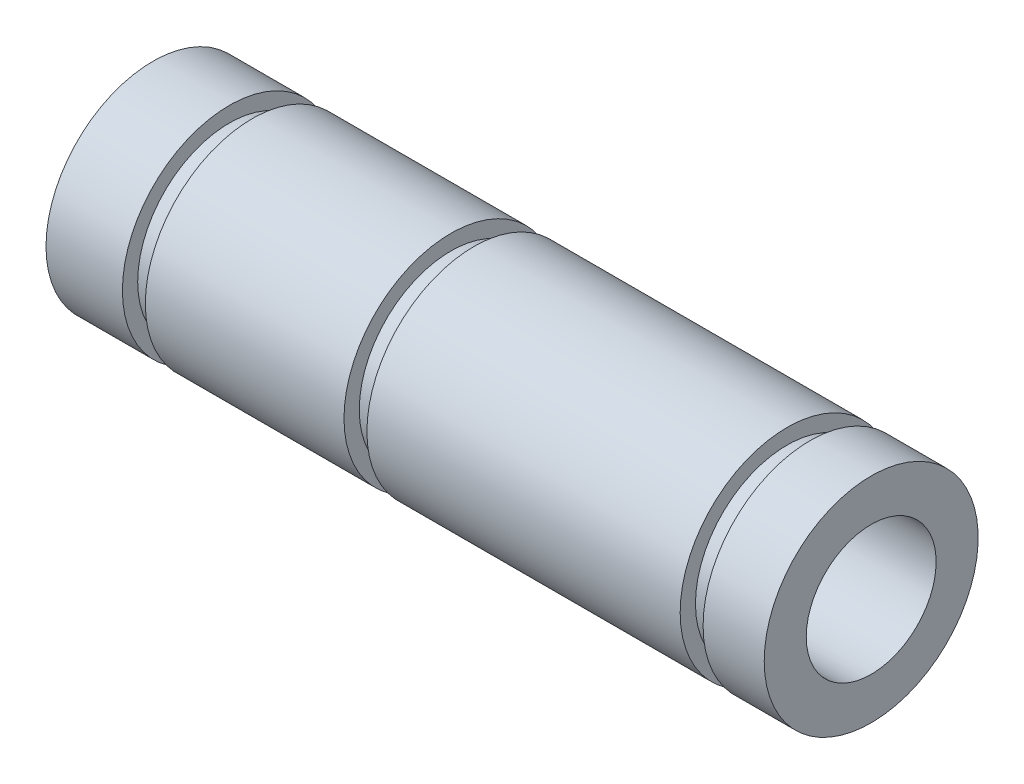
from build123d import *


with BuildPart() as part:
    # Esquisse1 → R_volution1 (revolve)
    with BuildSketch(Plane.XY, mode=Mode.PRIVATE) as r_volution1_sk:
        Polygon((0, 7), (5, 7), (5, 6), (6.5, 6), (6.5, 7), (19.5, 7), (19.5, 6), (21, 6), (21, 7), (41.5, 7), (41.5, 6), (43, 6), (43, 7), (47, 7), (47, 4.25), (0, 4.25), align=None)
    revolve(r_volution1_sk.sketch.rotate(Axis((0, 0, 0), (1, 0, 0)), 90), axis=Axis((0, 0, 0), (1, 0, 0)))


solid = part.part
